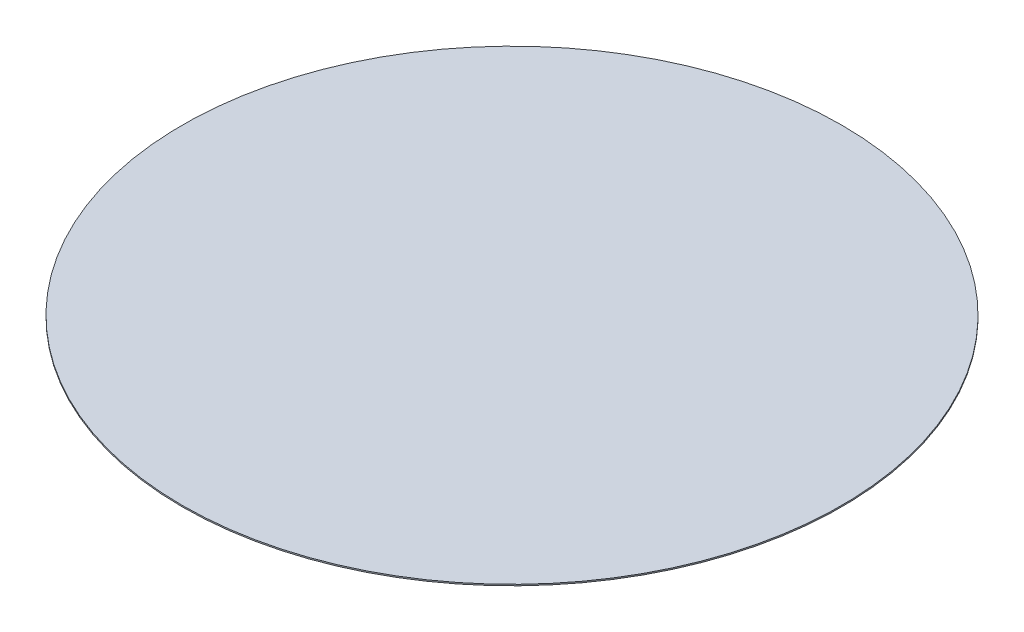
ISO-10303-21;
HEADER;
FILE_DESCRIPTION(('STEP AP214'),'2;1');
FILE_NAME('part.step','',(''),(''),'','','');
FILE_SCHEMA(('AUTOMOTIVE_DESIGN { 1 0 10303 214 1 1 1 1 }'));
ENDSEC;
DATA;
#1=APPLICATION_CONTEXT('core data for automotive mechanical design processes');
#2=APPLICATION_PROTOCOL_DEFINITION('international standard','automotive_design',2000,#1);
#3=PRODUCT_CONTEXT('',#1,'mechanical');
#4=PRODUCT('Part','Part','',(#3));
#5=PRODUCT_RELATED_PRODUCT_CATEGORY('part','',(#4));
#6=PRODUCT_DEFINITION_FORMATION('','',#4);
#7=PRODUCT_DEFINITION_CONTEXT('part definition',#1,'design');
#8=PRODUCT_DEFINITION('design','',#6,#7);
#9=PRODUCT_DEFINITION_SHAPE('','',#8);
#10=(LENGTH_UNIT() NAMED_UNIT(*) SI_UNIT(.MILLI.,.METRE.));
#11=(NAMED_UNIT(*) PLANE_ANGLE_UNIT() SI_UNIT($,.RADIAN.));
#12=(NAMED_UNIT(*) SI_UNIT($,.STERADIAN.) SOLID_ANGLE_UNIT());
#13=UNCERTAINTY_MEASURE_WITH_UNIT(LENGTH_MEASURE(1.E-05),#10,'distance_accuracy_value','');
#14=(GEOMETRIC_REPRESENTATION_CONTEXT(3) GLOBAL_UNCERTAINTY_ASSIGNED_CONTEXT((#13)) GLOBAL_UNIT_ASSIGNED_CONTEXT((#10,
#11,#12)) REPRESENTATION_CONTEXT('',''));
#15=CARTESIAN_POINT('',(0.,0.,0.));
#16=DIRECTION('',(0.,0.,1.));
#17=DIRECTION('',(1.,0.,0.));
#18=AXIS2_PLACEMENT_3D('',#15,#16,#17);
#19=CARTESIAN_POINT('',(0.,-0.2,0.));
#20=DIRECTION('',(0.,1.,0.));
#21=DIRECTION('',(0.,0.,1.));
#22=AXIS2_PLACEMENT_3D('',#19,#20,#21);
#23=CYLINDRICAL_SURFACE('',#22,50.);
#24=CARTESIAN_POINT('',(0.,-0.2,0.));
#25=DIRECTION('',(0.,1.,0.));
#26=DIRECTION('',(0.,0.,1.));
#27=AXIS2_PLACEMENT_3D('',#24,#25,#26);
#28=CIRCLE('',#27,50.);
#29=CARTESIAN_POINT('',(0.,-0.2,50.));
#30=VERTEX_POINT('',#29);
#31=EDGE_CURVE('E10',#30,#30,#28,.T.);
#32=ORIENTED_EDGE('',*,*,#31,.T.);
#33=EDGE_LOOP('',(#32));
#34=FACE_BOUND('',#33,.T.);
#35=CARTESIAN_POINT('',(0.,0.,0.));
#36=DIRECTION('',(0.,1.,0.));
#37=DIRECTION('',(0.,0.,1.));
#38=AXIS2_PLACEMENT_3D('',#35,#36,#37);
#39=CIRCLE('',#38,50.);
#40=CARTESIAN_POINT('',(0.,0.,50.));
#41=VERTEX_POINT('',#40);
#42=EDGE_CURVE('E33',#41,#41,#39,.T.);
#43=ORIENTED_EDGE('',*,*,#42,.F.);
#44=EDGE_LOOP('',(#43));
#45=FACE_BOUND('',#44,.T.);
#46=ADVANCED_FACE('F30',(#34,#45),#23,.T.);
#47=CARTESIAN_POINT('',(0.,-0.2,0.));
#48=DIRECTION('',(0.,1.,0.));
#49=DIRECTION('',(0.,0.,1.));
#50=AXIS2_PLACEMENT_3D('',#47,#48,#49);
#51=PLANE('',#50);
#52=ORIENTED_EDGE('',*,*,#31,.F.);
#53=EDGE_LOOP('',(#52));
#54=FACE_BOUND('',#53,.T.);
#55=ADVANCED_FACE('F45',(#54),#51,.F.);
#56=CARTESIAN_POINT('',(0.,0.,0.));
#57=DIRECTION('',(0.,1.,0.));
#58=DIRECTION('',(0.,0.,1.));
#59=AXIS2_PLACEMENT_3D('',#56,#57,#58);
#60=PLANE('',#59);
#61=ORIENTED_EDGE('',*,*,#42,.T.);
#62=EDGE_LOOP('',(#61));
#63=FACE_BOUND('',#62,.T.);
#64=ADVANCED_FACE('F42',(#63),#60,.T.);
#65=CLOSED_SHELL('',(#46,#55,#64));
#66=MANIFOLD_SOLID_BREP('B2',#65);
#67=ADVANCED_BREP_SHAPE_REPRESENTATION('',(#18,#66),#14);
#68=SHAPE_DEFINITION_REPRESENTATION(#9,#67);
ENDSEC;
END-ISO-10303-21;
